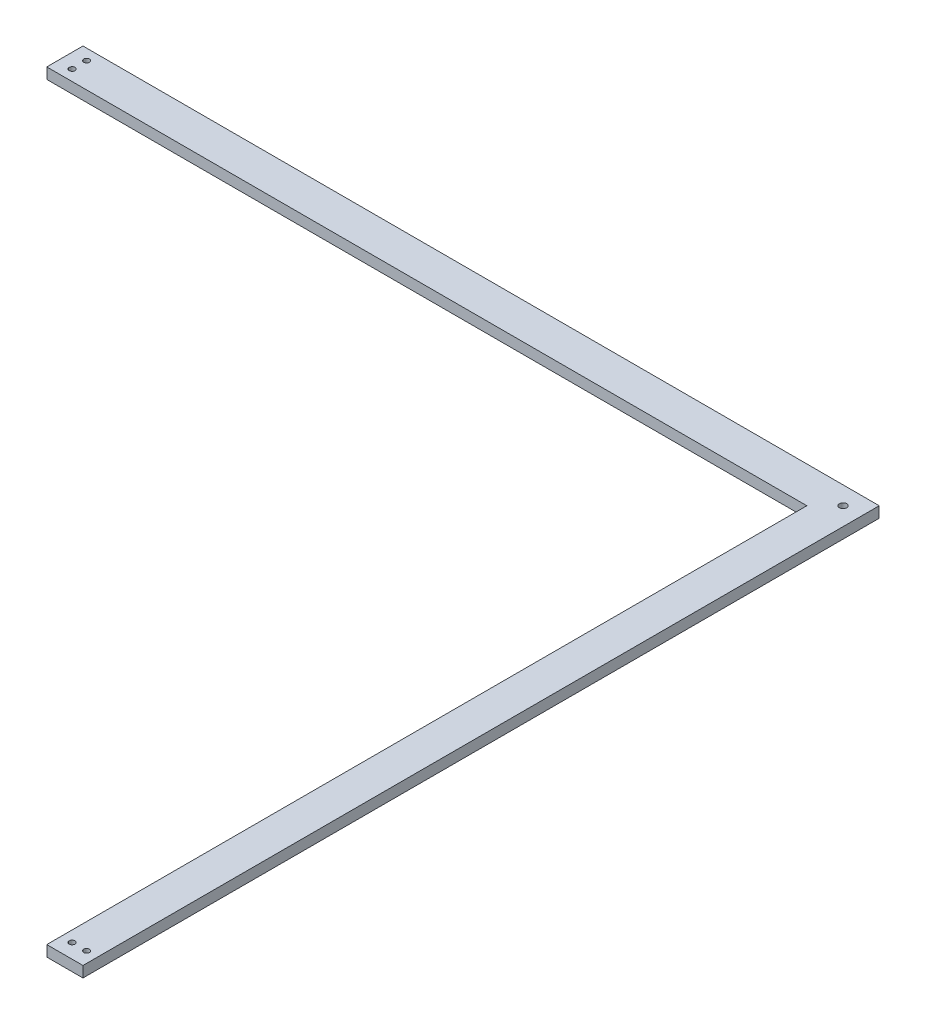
from build123d import *

# Parameters (mm, degrees)
SKETCH1_R           = 1
SKETCH1_R_2         = 0.8
BOSS_EXTRUDE1_DEPTH = 3


with BuildPart() as part:
    # Sketch1 → Boss-Extrude1 (new body)
    with BuildSketch(Plane(origin=(0, 0, 0), x_dir=(1, 0, 0), z_dir=(0, 1, 0))):
        Polygon((0, 220), (0, 210), (210, 210), (210, 0), (220, 0), (220, 220), align=None)
        with Locations(Location((215, 215, 0), (0, 0, 270))):
            Circle(SKETCH1_R, mode=Mode.SUBTRACT)
        with Locations(Location((217, 4, 0), (0, 0, 270))):
            Circle(SKETCH1_R_2, mode=Mode.SUBTRACT)
        with Locations(Location((213, 4, 0), (0, 0, 270))):
            Circle(SKETCH1_R_2, mode=Mode.SUBTRACT)
        with Locations(Location((4, 217, 0), (0, 0, 270))):
            Circle(SKETCH1_R_2, mode=Mode.SUBTRACT)
        with Locations(Location((4, 213, 0), (0, 0, 270))):
            Circle(SKETCH1_R_2, mode=Mode.SUBTRACT)
    extrude(amount=BOSS_EXTRUDE1_DEPTH)


solid = part.part
